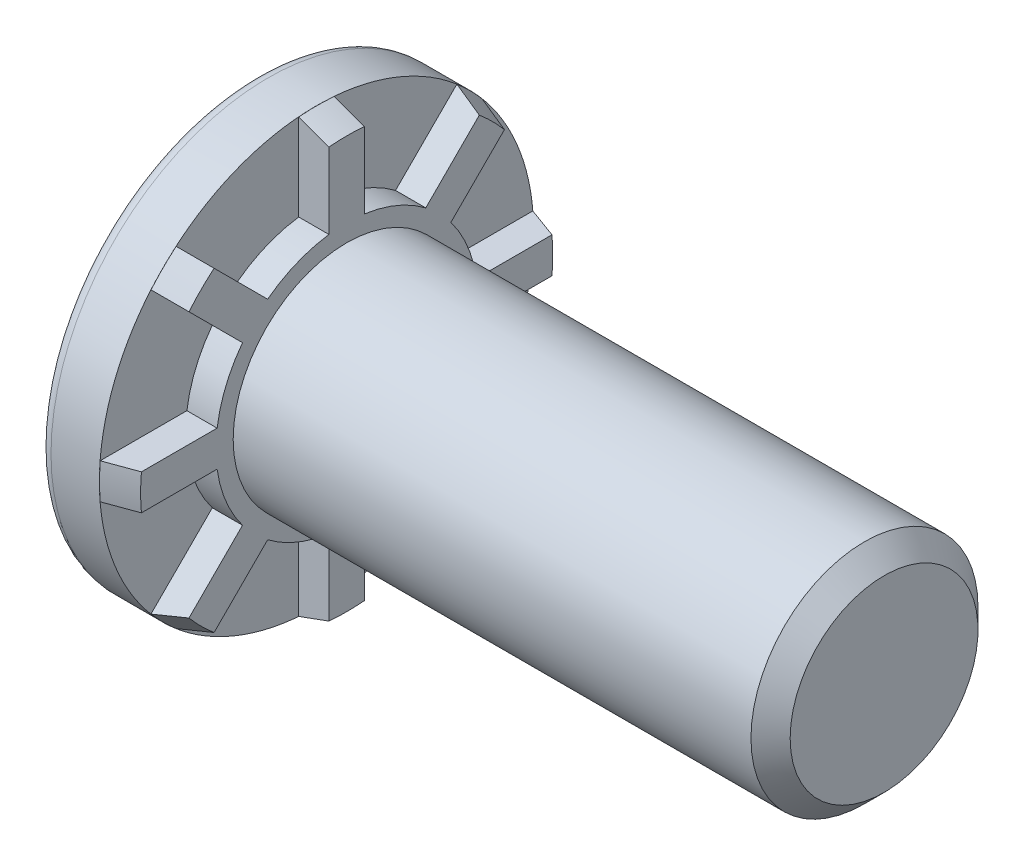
from build123d import *

# Parameters (mm, degrees)
RIBCUT_START     = -1.065
RIBCUT_DEPTH     = 1.065
RIBCUTSPAT_COUNT = 8
RIBCUTSPAT_ANGLE = 315


with BuildPart() as part:
    # BodySke → BaseBody (revolve)
    with BuildSketch(Plane.XY, mode=Mode.PRIVATE) as basebody_sk:
        with BuildLine():
            Line((-2.13, 7.224), (-2.13, 0))
            Line((-2.13, 0), (20, 0))
            Line((20, 0), (20, 3.3095))
            Line((20, 3.3095), (19.3095, 4))
            Line((19.3095, 4), (1.065, 4))
            Line((1.065, 4), (1.065, 7.260756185))
            Line((1.065, 7.260756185), (0.00254, 7.64746))
            Line((0.00254, 7.64746), (0, 7.64746))
            Line((0, 7.64746), (0, 7.65))
            Line((0, 7.65), (-1.704, 7.65))
            ThreePointArc((-1.704, 7.65), (-2.005227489, 7.525227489), (-2.13, 7.224))
        make_face()
    revolve(basebody_sk.sketch.rotate(Axis((0, 0, 0), (1, 0, 0)), 90), axis=Axis((0, 0, 0), (1, 0, 0)))

    # RibCutSke → RibCut (cut)
    with BuildSketch(Plane(origin=(1.065, 1.794401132, -0.090952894), x_dir=(0, 0, -1), z_dir=(1, 0, 0)).offset(RIBCUT_START)):
        with BuildLine():
            Line((0.534784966, 2.771251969), (0.534784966, 5.829964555))
            ThreePointArc((0.534784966, 5.829964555), (2.836575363, 5.273277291), (4.857824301, 4.039303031))
            Line((4.857824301, 4.039303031), (2.69498789, 1.87646662))
            ThreePointArc((2.69498789, 1.87646662), (1.672579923, 2.463143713), (0.534784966, 2.771251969))
        make_face()
    ribcut = extrude(amount=RIBCUT_DEPTH, mode=Mode.SUBTRACT)

    # RibCutsPat: RibCut ×8 about axis
    ribcutspat_axis = Axis((0, 0, 0), (1, 0, 0))
    for i in range(1, RIBCUTSPAT_COUNT):
        add(ribcut.rotate(ribcutspat_axis, i * RIBCUTSPAT_ANGLE / (RIBCUTSPAT_COUNT - 1)), mode=Mode.SUBTRACT)


solid = part.part
